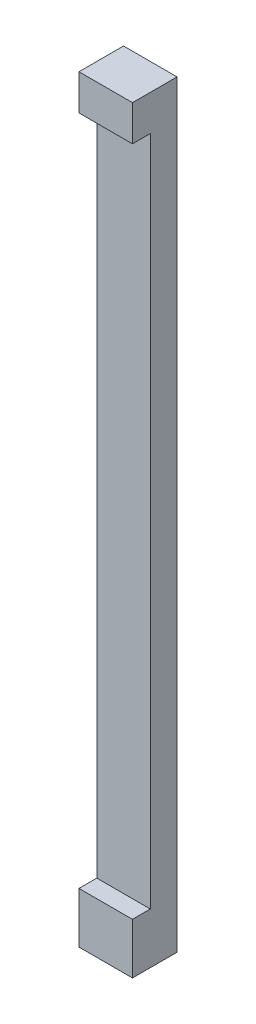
ISO-10303-21;
HEADER;
FILE_DESCRIPTION(('STEP AP214'),'2;1');
FILE_NAME('part.step','',(''),(''),'','','');
FILE_SCHEMA(('AUTOMOTIVE_DESIGN { 1 0 10303 214 1 1 1 1 }'));
ENDSEC;
DATA;
#1=APPLICATION_CONTEXT('core data for automotive mechanical design processes');
#2=APPLICATION_PROTOCOL_DEFINITION('international standard','automotive_design',2000,#1);
#3=PRODUCT_CONTEXT('',#1,'mechanical');
#4=PRODUCT('Part','Part','',(#3));
#5=PRODUCT_RELATED_PRODUCT_CATEGORY('part','',(#4));
#6=PRODUCT_DEFINITION_FORMATION('','',#4);
#7=PRODUCT_DEFINITION_CONTEXT('part definition',#1,'design');
#8=PRODUCT_DEFINITION('design','',#6,#7);
#9=PRODUCT_DEFINITION_SHAPE('','',#8);
#10=(LENGTH_UNIT() NAMED_UNIT(*) SI_UNIT(.MILLI.,.METRE.));
#11=(NAMED_UNIT(*) PLANE_ANGLE_UNIT() SI_UNIT($,.RADIAN.));
#12=(NAMED_UNIT(*) SI_UNIT($,.STERADIAN.) SOLID_ANGLE_UNIT());
#13=UNCERTAINTY_MEASURE_WITH_UNIT(LENGTH_MEASURE(1.E-05),#10,'distance_accuracy_value','');
#14=(GEOMETRIC_REPRESENTATION_CONTEXT(3) GLOBAL_UNCERTAINTY_ASSIGNED_CONTEXT((#13)) GLOBAL_UNIT_ASSIGNED_CONTEXT((#10,
#11,#12)) REPRESENTATION_CONTEXT('',''));
#15=CARTESIAN_POINT('',(0.,0.,0.));
#16=DIRECTION('',(0.,0.,1.));
#17=DIRECTION('',(1.,0.,0.));
#18=AXIS2_PLACEMENT_3D('',#15,#16,#17);
#19=CARTESIAN_POINT('',(30.,850.,50.));
#20=DIRECTION('',(0.,0.,-1.));
#21=DIRECTION('',(-1.,0.,0.));
#22=AXIS2_PLACEMENT_3D('',#19,#20,#21);
#23=PLANE('',#22);
#24=DIRECTION('',(0.,1.,0.));
#25=VECTOR('',#24,1.);
#26=CARTESIAN_POINT('',(30.,850.,50.));
#27=LINE('',#26,#25);
#28=CARTESIAN_POINT('',(30.0000000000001,0.,50.));
#29=VERTEX_POINT('',#28);
#30=CARTESIAN_POINT('',(30.0000000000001,56.9999999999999,50.0000000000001));
#31=VERTEX_POINT('',#30);
#32=EDGE_CURVE('E143',#29,#31,#27,.T.);
#33=ORIENTED_EDGE('',*,*,#32,.T.);
#34=DIRECTION('',(-1.,0.,0.));
#35=VECTOR('',#34,1.);
#36=CARTESIAN_POINT('',(30.0000000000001,56.9999999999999,50.0000000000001));
#37=LINE('',#36,#35);
#38=CARTESIAN_POINT('',(-30.,56.9999999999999,50.0000000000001));
#39=VERTEX_POINT('',#38);
#40=EDGE_CURVE('E125',#31,#39,#37,.T.);
#41=ORIENTED_EDGE('',*,*,#40,.T.);
#42=DIRECTION('',(0.,-1.,0.));
#43=VECTOR('',#42,1.);
#44=CARTESIAN_POINT('',(-30.0000000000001,850.,50.));
#45=LINE('',#44,#43);
#46=CARTESIAN_POINT('',(-30.,0.,50.));
#47=VERTEX_POINT('',#46);
#48=EDGE_CURVE('E147',#39,#47,#45,.T.);
#49=ORIENTED_EDGE('',*,*,#48,.T.);
#50=DIRECTION('',(1.,0.,0.));
#51=VECTOR('',#50,1.);
#52=CARTESIAN_POINT('',(30.0000000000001,0.,50.));
#53=LINE('',#52,#51);
#54=EDGE_CURVE('E48',#47,#29,#53,.T.);
#55=ORIENTED_EDGE('',*,*,#54,.T.);
#56=EDGE_LOOP('',(#33,#41,#49,#55));
#57=FACE_BOUND('',#56,.T.);
#58=ADVANCED_FACE('F24',(#57),#23,.F.);
#59=CARTESIAN_POINT('',(30.,850.,50.));
#60=DIRECTION('',(-1.,0.,0.));
#61=DIRECTION('',(0.,-1.,0.));
#62=AXIS2_PLACEMENT_3D('',#59,#60,#61);
#63=PLANE('',#62);
#64=DIRECTION('',(0.,-1.,0.));
#65=VECTOR('',#64,1.);
#66=CARTESIAN_POINT('',(30.0000000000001,810.,30.));
#67=LINE('',#66,#65);
#68=CARTESIAN_POINT('',(30.0000000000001,810.,30.));
#69=VERTEX_POINT('',#68);
#70=CARTESIAN_POINT('',(30.0000000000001,56.9999999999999,30.0000000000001));
#71=VERTEX_POINT('',#70);
#72=EDGE_CURVE('E118',#69,#71,#67,.T.);
#73=ORIENTED_EDGE('',*,*,#72,.T.);
#74=DIRECTION('',(0.,0.,1.));
#75=VECTOR('',#74,1.);
#76=CARTESIAN_POINT('',(30.0000000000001,56.9999999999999,50.0000000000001));
#77=LINE('',#76,#75);
#78=EDGE_CURVE('E121',#71,#31,#77,.T.);
#79=ORIENTED_EDGE('',*,*,#78,.T.);
#80=ORIENTED_EDGE('',*,*,#32,.F.);
#81=DIRECTION('',(0.,0.,-1.));
#82=VECTOR('',#81,1.);
#83=CARTESIAN_POINT('',(30.0000000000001,0.,50.));
#84=LINE('',#83,#82);
#85=CARTESIAN_POINT('',(30.0000000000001,0.,0.));
#86=VERTEX_POINT('',#85);
#87=EDGE_CURVE('E152',#29,#86,#84,.T.);
#88=ORIENTED_EDGE('',*,*,#87,.T.);
#89=DIRECTION('',(0.,1.,0.));
#90=VECTOR('',#89,1.);
#91=CARTESIAN_POINT('',(30.,850.,0.));
#92=LINE('',#91,#90);
#93=CARTESIAN_POINT('',(30.,850.,0.));
#94=VERTEX_POINT('',#93);
#95=EDGE_CURVE('E128',#86,#94,#92,.T.);
#96=ORIENTED_EDGE('',*,*,#95,.T.);
#97=DIRECTION('',(0.,0.,-1.));
#98=VECTOR('',#97,1.);
#99=CARTESIAN_POINT('',(30.,850.,50.));
#100=LINE('',#99,#98);
#101=CARTESIAN_POINT('',(30.,850.,50.));
#102=VERTEX_POINT('',#101);
#103=EDGE_CURVE('E11',#102,#94,#100,.T.);
#104=ORIENTED_EDGE('',*,*,#103,.F.);
#105=CARTESIAN_POINT('',(30.,810.,50.));
#106=VERTEX_POINT('',#105);
#107=EDGE_CURVE('E142',#106,#102,#27,.T.);
#108=ORIENTED_EDGE('',*,*,#107,.F.);
#109=DIRECTION('',(0.,0.,-1.));
#110=VECTOR('',#109,1.);
#111=CARTESIAN_POINT('',(30.0000000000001,810.,50.));
#112=LINE('',#111,#110);
#113=EDGE_CURVE('E40',#106,#69,#112,.T.);
#114=ORIENTED_EDGE('',*,*,#113,.T.);
#115=EDGE_LOOP('',(#73,#79,#80,#88,#96,#104,#108,#114));
#116=FACE_BOUND('',#115,.T.);
#117=ADVANCED_FACE('F26',(#116),#63,.F.);
#118=CARTESIAN_POINT('',(30.,850.,50.));
#119=DIRECTION('',(0.,-1.,0.));
#120=DIRECTION('',(0.,0.,-1.));
#121=AXIS2_PLACEMENT_3D('',#118,#119,#120);
#122=PLANE('',#121);
#123=DIRECTION('',(-1.,0.,0.));
#124=VECTOR('',#123,1.);
#125=CARTESIAN_POINT('',(30.,850.,0.));
#126=LINE('',#125,#124);
#127=CARTESIAN_POINT('',(-30.0000000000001,850.,0.));
#128=VERTEX_POINT('',#127);
#129=EDGE_CURVE('E136',#94,#128,#126,.T.);
#130=ORIENTED_EDGE('',*,*,#129,.T.);
#131=DIRECTION('',(0.,0.,-1.));
#132=VECTOR('',#131,1.);
#133=CARTESIAN_POINT('',(-30.0000000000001,850.,50.));
#134=LINE('',#133,#132);
#135=CARTESIAN_POINT('',(-30.0000000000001,850.,50.));
#136=VERTEX_POINT('',#135);
#137=EDGE_CURVE('E33',#136,#128,#134,.T.);
#138=ORIENTED_EDGE('',*,*,#137,.F.);
#139=DIRECTION('',(-1.,0.,0.));
#140=VECTOR('',#139,1.);
#141=CARTESIAN_POINT('',(30.,850.,50.));
#142=LINE('',#141,#140);
#143=EDGE_CURVE('E145',#102,#136,#142,.T.);
#144=ORIENTED_EDGE('',*,*,#143,.F.);
#145=ORIENTED_EDGE('',*,*,#103,.T.);
#146=EDGE_LOOP('',(#130,#138,#144,#145));
#147=FACE_BOUND('',#146,.T.);
#148=ADVANCED_FACE('F190',(#147),#122,.F.);
#149=CARTESIAN_POINT('',(-30.0000000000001,850.,50.));
#150=DIRECTION('',(1.,0.,0.));
#151=DIRECTION('',(0.,1.,0.));
#152=AXIS2_PLACEMENT_3D('',#149,#150,#151);
#153=PLANE('',#152);
#154=ORIENTED_EDGE('',*,*,#48,.F.);
#155=DIRECTION('',(0.,0.,1.));
#156=VECTOR('',#155,1.);
#157=CARTESIAN_POINT('',(-30.,56.9999999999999,50.0000000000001));
#158=LINE('',#157,#156);
#159=CARTESIAN_POINT('',(-30.,56.9999999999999,30.0000000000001));
#160=VERTEX_POINT('',#159);
#161=EDGE_CURVE('E115',#160,#39,#158,.T.);
#162=ORIENTED_EDGE('',*,*,#161,.F.);
#163=DIRECTION('',(0.,-1.,0.));
#164=VECTOR('',#163,1.);
#165=CARTESIAN_POINT('',(-30.,810.,30.));
#166=LINE('',#165,#164);
#167=CARTESIAN_POINT('',(-30.,810.,30.));
#168=VERTEX_POINT('',#167);
#169=EDGE_CURVE('E112',#168,#160,#166,.T.);
#170=ORIENTED_EDGE('',*,*,#169,.F.);
#171=DIRECTION('',(0.,0.,-1.));
#172=VECTOR('',#171,1.);
#173=CARTESIAN_POINT('',(-30.,810.,50.));
#174=LINE('',#173,#172);
#175=CARTESIAN_POINT('',(-30.,810.,50.));
#176=VERTEX_POINT('',#175);
#177=EDGE_CURVE('E109',#176,#168,#174,.T.);
#178=ORIENTED_EDGE('',*,*,#177,.F.);
#179=EDGE_CURVE('E148',#136,#176,#45,.T.);
#180=ORIENTED_EDGE('',*,*,#179,.F.);
#181=ORIENTED_EDGE('',*,*,#137,.T.);
#182=DIRECTION('',(0.,-1.,0.));
#183=VECTOR('',#182,1.);
#184=CARTESIAN_POINT('',(-30.0000000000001,850.,0.));
#185=LINE('',#184,#183);
#186=CARTESIAN_POINT('',(-30.,0.,0.));
#187=VERTEX_POINT('',#186);
#188=EDGE_CURVE('E138',#128,#187,#185,.T.);
#189=ORIENTED_EDGE('',*,*,#188,.T.);
#190=DIRECTION('',(0.,0.,-1.));
#191=VECTOR('',#190,1.);
#192=CARTESIAN_POINT('',(-30.,0.,50.));
#193=LINE('',#192,#191);
#194=EDGE_CURVE('E155',#47,#187,#193,.T.);
#195=ORIENTED_EDGE('',*,*,#194,.F.);
#196=EDGE_LOOP('',(#154,#162,#170,#178,#180,#181,#189,#195));
#197=FACE_BOUND('',#196,.T.);
#198=ADVANCED_FACE('F164',(#197),#153,.F.);
#199=CARTESIAN_POINT('',(30.0000000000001,0.,50.));
#200=DIRECTION('',(0.,1.,0.));
#201=DIRECTION('',(-1.,0.,0.));
#202=AXIS2_PLACEMENT_3D('',#199,#200,#201);
#203=PLANE('',#202);
#204=DIRECTION('',(1.,0.,0.));
#205=VECTOR('',#204,1.);
#206=CARTESIAN_POINT('',(30.0000000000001,0.,0.));
#207=LINE('',#206,#205);
#208=EDGE_CURVE('E140',#187,#86,#207,.T.);
#209=ORIENTED_EDGE('',*,*,#208,.T.);
#210=ORIENTED_EDGE('',*,*,#87,.F.);
#211=ORIENTED_EDGE('',*,*,#54,.F.);
#212=ORIENTED_EDGE('',*,*,#194,.T.);
#213=EDGE_LOOP('',(#209,#210,#211,#212));
#214=FACE_BOUND('',#213,.T.);
#215=ADVANCED_FACE('F174',(#214),#203,.F.);
#216=ORIENTED_EDGE('',*,*,#179,.T.);
#217=DIRECTION('',(-1.,0.,0.));
#218=VECTOR('',#217,1.);
#219=CARTESIAN_POINT('',(30.0000000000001,810.,50.));
#220=LINE('',#219,#218);
#221=EDGE_CURVE('E124',#106,#176,#220,.T.);
#222=ORIENTED_EDGE('',*,*,#221,.F.);
#223=ORIENTED_EDGE('',*,*,#107,.T.);
#224=ORIENTED_EDGE('',*,*,#143,.T.);
#225=EDGE_LOOP('',(#216,#222,#223,#224));
#226=FACE_BOUND('',#225,.T.);
#227=ADVANCED_FACE('F188',(#226),#23,.F.);
#228=CARTESIAN_POINT('',(30.,850.,0.));
#229=DIRECTION('',(0.,0.,-1.));
#230=DIRECTION('',(-1.,0.,0.));
#231=AXIS2_PLACEMENT_3D('',#228,#229,#230);
#232=PLANE('',#231);
#233=CARTESIAN_POINT('',(2.1726827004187E-06,24.9999999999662,0.));
#234=DIRECTION('',(0.,0.,-1.));
#235=DIRECTION('',(-1.,0.,0.));
#236=AXIS2_PLACEMENT_3D('',#233,#234,#235);
#237=CIRCLE('',#236,3.99999999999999);
#238=CARTESIAN_POINT('',(-3.99999782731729,24.9999999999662,0.));
#239=VERTEX_POINT('',#238);
#240=EDGE_CURVE('E28',#239,#239,#237,.T.);
#241=ORIENTED_EDGE('',*,*,#240,.F.);
#242=EDGE_LOOP('',(#241));
#243=FACE_BOUND('',#242,.T.);
#244=ORIENTED_EDGE('',*,*,#95,.F.);
#245=ORIENTED_EDGE('',*,*,#208,.F.);
#246=ORIENTED_EDGE('',*,*,#188,.F.);
#247=ORIENTED_EDGE('',*,*,#129,.F.);
#248=EDGE_LOOP('',(#244,#245,#246,#247));
#249=FACE_BOUND('',#248,.T.);
#250=ADVANCED_FACE('F172',(#243,#249),#232,.T.);
#251=CARTESIAN_POINT('',(30.0000000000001,56.9999999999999,50.0000000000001));
#252=DIRECTION('',(0.,-1.,0.));
#253=DIRECTION('',(0.,0.,-1.));
#254=AXIS2_PLACEMENT_3D('',#251,#252,#253);
#255=PLANE('',#254);
#256=ORIENTED_EDGE('',*,*,#161,.T.);
#257=ORIENTED_EDGE('',*,*,#40,.F.);
#258=ORIENTED_EDGE('',*,*,#78,.F.);
#259=DIRECTION('',(-1.,0.,0.));
#260=VECTOR('',#259,1.);
#261=CARTESIAN_POINT('',(30.0000000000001,56.9999999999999,30.0000000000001));
#262=LINE('',#261,#260);
#263=EDGE_CURVE('E129',#71,#160,#262,.T.);
#264=ORIENTED_EDGE('',*,*,#263,.T.);
#265=EDGE_LOOP('',(#256,#257,#258,#264));
#266=FACE_BOUND('',#265,.T.);
#267=ADVANCED_FACE('F182',(#266),#255,.F.);
#268=CARTESIAN_POINT('',(30.0000000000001,810.,30.));
#269=DIRECTION('',(0.,0.,-1.));
#270=DIRECTION('',(0.,1.,0.));
#271=AXIS2_PLACEMENT_3D('',#268,#269,#270);
#272=PLANE('',#271);
#273=ORIENTED_EDGE('',*,*,#169,.T.);
#274=ORIENTED_EDGE('',*,*,#263,.F.);
#275=ORIENTED_EDGE('',*,*,#72,.F.);
#276=DIRECTION('',(-1.,0.,0.));
#277=VECTOR('',#276,1.);
#278=CARTESIAN_POINT('',(30.0000000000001,810.,30.));
#279=LINE('',#278,#277);
#280=EDGE_CURVE('E131',#69,#168,#279,.T.);
#281=ORIENTED_EDGE('',*,*,#280,.T.);
#282=EDGE_LOOP('',(#273,#274,#275,#281));
#283=FACE_BOUND('',#282,.T.);
#284=ADVANCED_FACE('F185',(#283),#272,.F.);
#285=CARTESIAN_POINT('',(30.0000000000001,810.,50.));
#286=DIRECTION('',(0.,1.,0.));
#287=DIRECTION('',(0.,0.,1.));
#288=AXIS2_PLACEMENT_3D('',#285,#286,#287);
#289=PLANE('',#288);
#290=ORIENTED_EDGE('',*,*,#177,.T.);
#291=ORIENTED_EDGE('',*,*,#280,.F.);
#292=ORIENTED_EDGE('',*,*,#113,.F.);
#293=ORIENTED_EDGE('',*,*,#221,.T.);
#294=EDGE_LOOP('',(#290,#291,#292,#293));
#295=FACE_BOUND('',#294,.T.);
#296=ADVANCED_FACE('F186',(#295),#289,.F.);
#297=CARTESIAN_POINT('',(2.1726827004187E-06,24.9999999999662,-29.9999999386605));
#298=DIRECTION('',(0.,0.,-1.));
#299=DIRECTION('',(-1.,0.,0.));
#300=AXIS2_PLACEMENT_3D('',#297,#298,#299);
#301=CYLINDRICAL_SURFACE('',#300,3.99999999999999);
#302=ORIENTED_EDGE('',*,*,#240,.T.);
#303=EDGE_LOOP('',(#302));
#304=FACE_BOUND('',#303,.T.);
#305=CARTESIAN_POINT('',(2.1726827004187E-06,24.9999999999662,16.));
#306=DIRECTION('',(0.,0.,-1.));
#307=DIRECTION('',(-1.,0.,0.));
#308=AXIS2_PLACEMENT_3D('',#305,#306,#307);
#309=CIRCLE('',#308,3.99999999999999);
#310=CARTESIAN_POINT('',(-3.99999782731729,24.9999999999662,16.));
#311=VERTEX_POINT('',#310);
#312=EDGE_CURVE('E104',#311,#311,#309,.T.);
#313=ORIENTED_EDGE('',*,*,#312,.F.);
#314=EDGE_LOOP('',(#313));
#315=FACE_BOUND('',#314,.T.);
#316=ADVANCED_FACE('F242',(#304,#315),#301,.F.);
#317=CARTESIAN_POINT('',(3.40000217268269,24.9999999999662,16.));
#318=DIRECTION('',(0.,0.,1.));
#319=DIRECTION('',(1.,0.,0.));
#320=AXIS2_PLACEMENT_3D('',#317,#318,#319);
#321=PLANE('',#320);
#322=CARTESIAN_POINT('',(2.1726827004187E-06,24.9999999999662,16.));
#323=DIRECTION('',(0.,0.,-1.));
#324=DIRECTION('',(-1.,0.,0.));
#325=AXIS2_PLACEMENT_3D('',#322,#323,#324);
#326=CIRCLE('',#325,3.39999999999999);
#327=CARTESIAN_POINT('',(-3.39999782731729,24.9999999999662,16.));
#328=VERTEX_POINT('',#327);
#329=EDGE_CURVE('E101',#328,#328,#326,.T.);
#330=ORIENTED_EDGE('',*,*,#329,.F.);
#331=EDGE_LOOP('',(#330));
#332=FACE_BOUND('',#331,.T.);
#333=ORIENTED_EDGE('',*,*,#312,.T.);
#334=EDGE_LOOP('',(#333));
#335=FACE_BOUND('',#334,.T.);
#336=ADVANCED_FACE('F248',(#332,#335),#321,.F.);
#337=CARTESIAN_POINT('',(2.1726827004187E-06,24.9999999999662,-29.9999999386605));
#338=DIRECTION('',(0.,0.,-1.));
#339=DIRECTION('',(-1.,0.,0.));
#340=AXIS2_PLACEMENT_3D('',#337,#338,#339);
#341=CYLINDRICAL_SURFACE('',#340,3.39999999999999);
#342=CARTESIAN_POINT('',(2.1726827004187E-06,24.9999999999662,22.25));
#343=DIRECTION('',(0.,0.,-1.));
#344=DIRECTION('',(-1.,0.,0.));
#345=AXIS2_PLACEMENT_3D('',#342,#343,#344);
#346=CIRCLE('',#345,3.39999999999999);
#347=CARTESIAN_POINT('',(-3.39999782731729,24.9999999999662,22.25));
#348=VERTEX_POINT('',#347);
#349=EDGE_CURVE('E99',#348,#348,#346,.T.);
#350=ORIENTED_EDGE('',*,*,#349,.F.);
#351=EDGE_LOOP('',(#350));
#352=FACE_BOUND('',#351,.T.);
#353=ORIENTED_EDGE('',*,*,#329,.T.);
#354=EDGE_LOOP('',(#353));
#355=FACE_BOUND('',#354,.T.);
#356=ADVANCED_FACE('F95',(#352,#355),#341,.F.);
#357=CARTESIAN_POINT('',(2.1726827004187E-06,24.9999999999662,22.25));
#358=DIRECTION('',(0.,0.,-1.));
#359=DIRECTION('',(-1.,0.,0.));
#360=AXIS2_PLACEMENT_3D('',#357,#358,#359);
#361=CONICAL_SURFACE('',#360,3.39999999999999,1.02974425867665);
#362=CARTESIAN_POINT('',(2.17268268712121E-06,24.9999999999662,24.2929261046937));
#363=VERTEX_POINT('',#362);
#364=VERTEX_LOOP('',#363);
#365=FACE_BOUND('',#364,.T.);
#366=ORIENTED_EDGE('',*,*,#349,.T.);
#367=EDGE_LOOP('',(#366));
#368=FACE_BOUND('',#367,.T.);
#369=ADVANCED_FACE('F92',(#365,#368),#361,.F.);
#370=CLOSED_SHELL('',(#58,#117,#148,#198,#215,#227,#250,#267,#284,#296,#316,#336,#356,#369));
#371=MANIFOLD_SOLID_BREP('B2',#370);
#372=ADVANCED_BREP_SHAPE_REPRESENTATION('',(#18,#371),#14);
#373=SHAPE_DEFINITION_REPRESENTATION(#9,#372);
ENDSEC;
END-ISO-10303-21;
